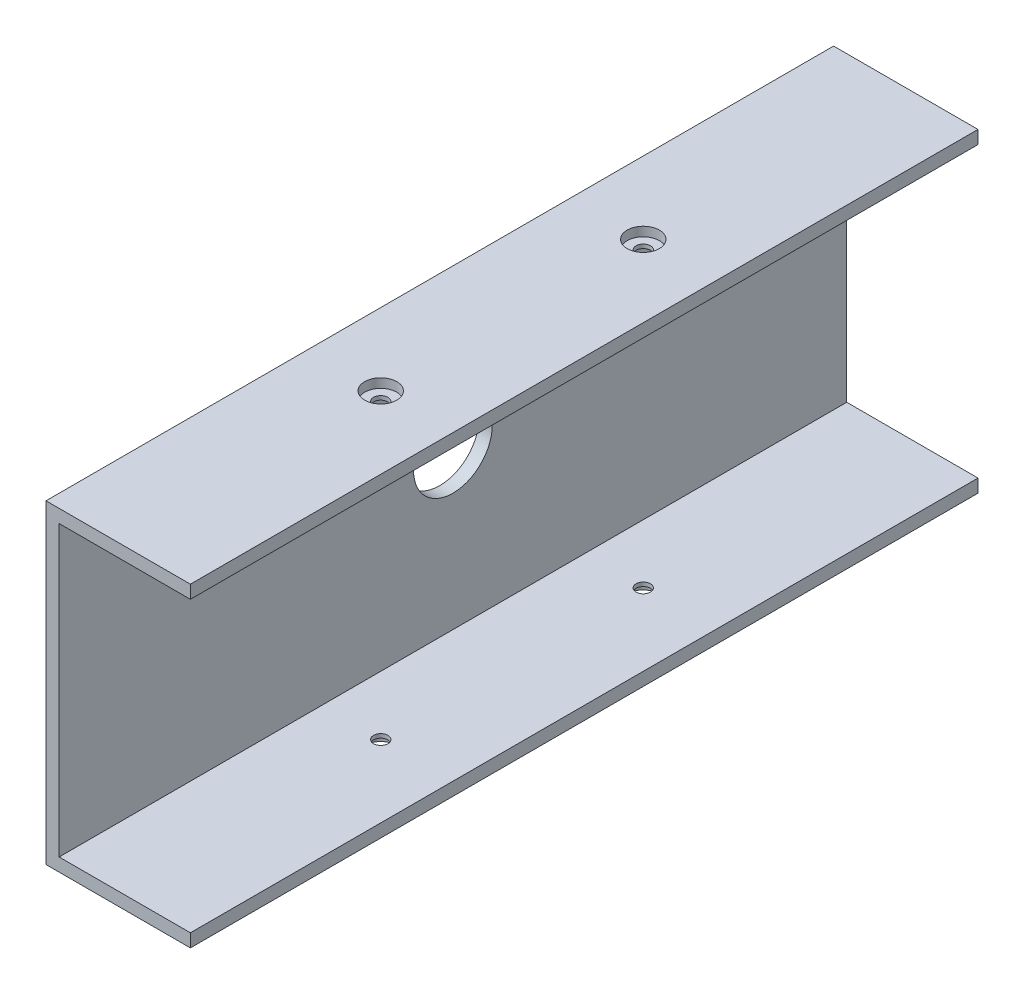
from build123d import *

# Parameters (mm, degrees)
BOSS_EXTRUDE1_DEPTH = 300
LPATTERN2_COUNT     = 2
LPATTERN2_PITCH     = 100
LPATTERN3_COUNT     = 2
LPATTERN3_PITCH     = 100
SKETCH9_R           = 15
CUT_EXTRUDE1_DEPTH  = 313.449732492


with BuildPart() as part:
    # Sketch1 → Boss-Extrude1 (new body)
    with BuildSketch(Plane.XY):
        Polygon((-64.668520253, 67.82208589), (-9.668520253, 67.82208589), (-9.668520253, 62.82208589), (-59.668520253, 62.82208589), (-59.668520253, -47.17791411), (-9.668520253, -47.17791411), (-9.668520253, -52.17791411), (-64.668520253, -52.17791411), align=None)
    extrude(amount=BOSS_EXTRUDE1_DEPTH)

    # Sketch4 → CBORE for M5 Hex Head Bolt1 (revolve, cut)
    with BuildSketch(Plane(origin=(-37.168520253, 67.82208589, 200), x_dir=(0, 0, 1), z_dir=(1, 0, 0))):
        Polygon((0, 0), (0, 11.702366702), (2.75, 10.05), (2.75, 3.5), (6.119, 3.5), (6.119, 0), align=None)
    cbore_for_m5_hex_head_bolt1 = revolve(axis=Axis((-37.168520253, 74.17208589, 200), (0, -1, 0)), mode=Mode.SUBTRACT)

    # LPattern2: CBORE for M5 Hex Head Bolt1 ×2
    with Locations(*[(0, 0, -i * LPATTERN2_PITCH) for i in range(1, LPATTERN2_COUNT)]):
        add(cbore_for_m5_hex_head_bolt1, mode=Mode.SUBTRACT)

    # Sketch8 → CBORE for M5 Hex Head Bolt3 (revolve, cut)
    with BuildSketch(Plane(origin=(-37.168520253, -52.17791411, 200), x_dir=(0, 0, -1), z_dir=(1, 0, 0))):
        Polygon((0, 0), (0, 11.702366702), (2.75, 10.05), (2.75, 3.5), (6.119, 3.5), (6.119, 0), align=None)
    cbore_for_m5_hex_head_bolt3 = revolve(axis=Axis((-37.168520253, -58.52791411, 200), (0, 1, 0)), mode=Mode.SUBTRACT)

    # LPattern3: CBORE for M5 Hex Head Bolt3 ×2
    with Locations(*[(0, 0, -i * LPATTERN3_PITCH) for i in range(1, LPATTERN3_COUNT)]):
        add(cbore_for_m5_hex_head_bolt3, mode=Mode.SUBTRACT)

    # Sketch9 → Cut-Extrude1 (cut, through all)
    with BuildSketch(Plane.ZY.offset(64.668520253)):
        with Locations(Location((150, 12.82208589, 0), (0, 0, 270))):
            Circle(SKETCH9_R)
    extrude(amount=-CUT_EXTRUDE1_DEPTH, mode=Mode.SUBTRACT)


solid = part.part
